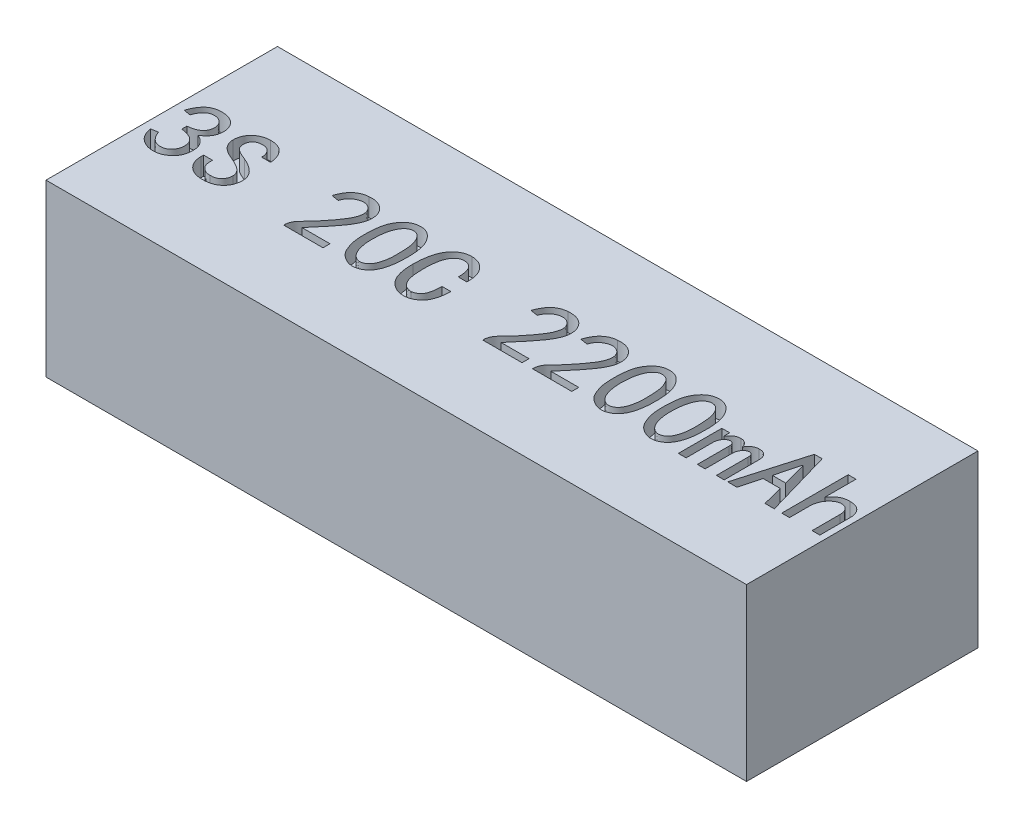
from build123d import *

# Parameters (mm, degrees)
SKETCH_1_W          = 115
SKETCH_1_H          = 38
EXTRUDE_1_DEPTH     = 28
CUT_EXTRUDE_1_DEPTH = 3


with BuildPart() as part:
    # Sketch 1 → Extrude 1 (new body)
    with BuildSketch(Plane(origin=(0, 0, 0), x_dir=(1, 0, 0), z_dir=(0, 1, 0))):
        with Locations((0, 11.87962963)):
            Rectangle(SKETCH_1_W, SKETCH_1_H)
    extrude(amount=EXTRUDE_1_DEPTH)

    # Sketch 2 → Cut-Extrude 1 (cut)
    # profile 1 of 12: a face of its own
    with BuildSketch(Plane(origin=(0, 28, 0), x_dir=(1, 0, 0), z_dir=(0, 1, 0))):
        with BuildLine():
            add(Edge.make_bspline(
                [(-23.615295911, 12.08931365), (-23.609218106, 12.226483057), (-23.597363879, 12.494020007), (-23.563114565, 12.884119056), (-23.52175503, 13.253314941), (-23.46798217, 13.600478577), (-23.401521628, 13.924454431), (-23.326296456, 14.226940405), (-23.23936192, 14.50709014), (-23.111352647, 14.849235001), (-22.919396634, 15.243039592), (-22.644824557, 15.675859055), (-22.325762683, 16.064933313), (-22.023920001, 16.350020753), (-21.762201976, 16.550666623), (-21.553094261, 16.680939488), (-21.33340684, 16.792247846), (-21.102419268, 16.88302215), (-20.86055631, 16.95064026), (-20.608458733, 17.000562), (-20.345294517, 17.031444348), (-20.074116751, 17.040632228), (-19.800895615, 17.027767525), (-19.532494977, 16.98585794), (-19.273493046, 16.911457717), (-19.023712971, 16.809317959), (-18.783834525, 16.67808103), (-18.552650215, 16.518801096), (-18.332900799, 16.327358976), (-18.121847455, 16.111528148), (-17.924717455, 15.873989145), (-17.744146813, 15.619326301), (-17.580885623, 15.350166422), (-17.437110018, 15.065032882), (-17.308232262, 14.766439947), (-17.200115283, 14.451727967), (-17.110667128, 14.122175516), (-17.012170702, 13.656624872), (-16.9255152, 13.039083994), (-16.864465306, 12.257513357), (-16.850534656, 11.424140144), (-16.871277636, 10.703442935), (-16.910378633, 10.119511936), (-16.954832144, 9.695979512), (-17.014540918, 9.294030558), (-17.084049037, 8.911708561), (-17.1710079, 8.551046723), (-17.274055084, 8.211658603), (-17.385392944, 7.89132708), (-17.516443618, 7.593419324), (-17.659178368, 7.315405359), (-17.821908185, 7.060846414), (-17.998203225, 6.826304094), (-18.192736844, 6.613637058), (-18.40804354, 6.427129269), (-18.636632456, 6.257781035), (-18.884642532, 6.113646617), (-19.145464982, 5.991334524), (-19.41409247, 5.893989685), (-19.68717132, 5.8305432), (-19.95955004, 5.792833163), (-20.233148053, 5.792695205), (-20.506344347, 5.8164833), (-20.778016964, 5.879059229), (-21.051516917, 5.965094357), (-21.319518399, 6.086764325), (-21.577463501, 6.226861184), (-21.820258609, 6.377647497), (-22.041268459, 6.541724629), (-22.242258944, 6.716945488), (-22.425737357, 6.901838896), (-22.589538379, 7.098160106), (-22.73196184, 7.306452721), (-22.891117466, 7.599596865), (-23.061623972, 7.9777173), (-23.238097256, 8.443470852), (-23.382329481, 8.920427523), (-23.475073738, 9.330301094), (-23.536219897, 9.673191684), (-23.569862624, 9.954276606), (-23.599086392, 10.256853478), (-23.616748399, 10.580992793), (-23.628496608, 10.926975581), (-23.633609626, 11.295048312), (-23.628137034, 11.685168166), (-23.619651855, 11.952220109), (-23.615295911, 12.08931365)],
                knots=[0, 0, 0, 0, 1.18043416, 2.302333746, 3.366253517, 4.374302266, 5.321670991, 6.208995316, 7.053297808, 7.84229274, 9.348259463, 10.810477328, 12.240076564, 13.663562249, 14.3695339, 15.072606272, 15.778577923, 16.484387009, 17.202829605, 17.934942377, 18.692112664, 19.478485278, 20.265441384, 21.040673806, 21.808439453, 22.577161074, 23.356320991, 24.155029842, 24.986154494, 25.858111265, 26.748121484, 27.637306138, 28.540117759, 29.452135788, 30.380885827, 31.334339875, 32.310628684, 33.31521083, 35.42407972, 37.666773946, 40.052062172, 42.587025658, 43.863776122, 45.083322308, 46.247467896, 47.357025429, 48.423487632, 49.435172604, 50.405897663, 51.337337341, 52.231284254, 53.090220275, 53.931690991, 54.751583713, 55.562922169, 56.377338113, 57.194202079, 58.024663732, 58.851830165, 59.645552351, 60.431282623, 61.21044254, 61.99312915, 62.783838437, 63.60230231, 64.454612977, 65.309477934, 66.125301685, 66.909862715, 67.67340185, 68.415973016, 69.147238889, 69.868837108, 70.581506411, 72.0124375, 73.431838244, 74.861437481, 76.292961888, 77.042577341, 77.855187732, 78.726196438, 79.655959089, 80.645695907, 81.702690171, 82.820655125, 84, 84, 84, 84], degree=3))
        make_face()
        with BuildLine():
            add(Edge.make_bspline(
                [(-22.274972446, 12.472263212), (-22.289462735, 12.328158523), (-22.318009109, 12.044267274), (-22.341356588, 11.623120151), (-22.348009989, 11.213894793), (-22.341917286, 10.816425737), (-22.318420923, 10.431490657), (-22.278332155, 10.058344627), (-22.221226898, 9.69724956), (-22.151335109, 9.349163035), (-22.067595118, 9.019648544), (-21.968286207, 8.713183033), (-21.855248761, 8.431999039), (-21.730202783, 8.175672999), (-21.592940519, 7.943898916), (-21.440905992, 7.737992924), (-21.278364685, 7.553574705), (-21.100459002, 7.398593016), (-20.917990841, 7.268441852), (-20.731437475, 7.167315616), (-20.543841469, 7.095657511), (-20.35448681, 7.051842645), (-20.164056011, 7.037852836), (-19.972473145, 7.051403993), (-19.781155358, 7.098701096), (-19.591052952, 7.171190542), (-19.407620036, 7.271031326), (-19.234086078, 7.391589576), (-19.074069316, 7.535561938), (-18.927485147, 7.701403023), (-18.79517177, 7.890138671), (-18.674107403, 8.098542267), (-18.567803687, 8.330070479), (-18.44279967, 8.669069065), (-18.316908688, 9.120524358), (-18.2049069, 9.684656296), (-18.1388455, 10.272972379), (-18.121524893, 10.876584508), (-18.132786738, 11.47634776), (-18.146293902, 12.057352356), (-18.178772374, 12.609781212), (-18.217642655, 13.136447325), (-18.283609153, 13.639702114), (-18.405176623, 14.116909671), (-18.575456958, 14.569363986), (-18.75023127, 14.926530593), (-18.917730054, 15.185793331), (-19.049773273, 15.359751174), (-19.196571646, 15.505113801), (-19.351362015, 15.629036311), (-19.517745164, 15.723381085), (-19.694216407, 15.793953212), (-19.880698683, 15.837687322), (-20.074365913, 15.859251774), (-20.269479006, 15.855482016), (-20.461127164, 15.821236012), (-20.647006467, 15.761344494), (-20.828286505, 15.67608164), (-21.001163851, 15.560680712), (-21.168401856, 15.419440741), (-21.328116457, 15.249983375), (-21.485445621, 15.056907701), (-21.628957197, 14.832709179), (-21.761680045, 14.581564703), (-21.879380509, 14.300247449), (-21.984793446, 13.990385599), (-22.079464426, 13.651995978), (-22.159063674, 13.284875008), (-22.225116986, 12.888730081), (-22.257975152, 12.614249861), (-22.274972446, 12.472263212)],
                knots=[0, 0, 0, 0, 1.378198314, 2.715098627, 4.012594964, 5.272602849, 6.497213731, 7.681415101, 8.842769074, 9.975170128, 11.059162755, 12.076494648, 13.038717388, 13.940857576, 14.788360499, 15.598271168, 16.373595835, 17.122768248, 17.838466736, 18.502782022, 19.136468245, 19.744060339, 20.345653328, 20.947246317, 21.563841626, 22.214212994, 22.87852828, 23.546305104, 24.220743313, 24.921956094, 25.648106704, 26.41081768, 27.212668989, 28.069279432, 29.84713992, 31.666334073, 33.537864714, 35.473745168, 37.408579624, 39.246547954, 41.003985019, 42.674193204, 44.272363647, 45.827394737, 47.348405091, 48.867584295, 49.599750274, 50.283750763, 50.94125936, 51.560811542, 52.165388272, 52.754418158, 53.363720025, 53.982318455, 54.604903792, 55.213928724, 55.828148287, 56.458765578, 57.113918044, 57.800421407, 58.537638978, 59.326979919, 60.167286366, 61.066273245, 62.027297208, 63.065989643, 64.179487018, 65.369443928, 66.639232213, 68, 68, 68, 68], degree=3))
        make_face(mode=Mode.SUBTRACT)
    # profile 2 of 12: a face of its own
    with BuildSketch(Plane(origin=(0, 28, 0), x_dir=(1, 0, 0), z_dir=(0, 1, 0))):
        with BuildLine():
            add(Edge.make_bspline(
                [(17.232657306, 12.08931365), (17.23873511, 12.226483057), (17.250589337, 12.494020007), (17.284838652, 12.884119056), (17.326198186, 13.253314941), (17.379971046, 13.600478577), (17.446431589, 13.924454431), (17.52165676, 14.226940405), (17.608591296, 14.50709014), (17.73660057, 14.849235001), (17.928556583, 15.243039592), (18.203128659, 15.675859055), (18.522190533, 16.064933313), (18.824033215, 16.350020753), (19.085751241, 16.550666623), (19.294858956, 16.680939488), (19.514546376, 16.792247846), (19.745533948, 16.88302215), (19.987396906, 16.95064026), (20.239494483, 17.000562), (20.502658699, 17.031444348), (20.773836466, 17.040632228), (21.047057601, 17.027767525), (21.31545824, 16.98585794), (21.57446017, 16.911457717), (21.824240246, 16.809317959), (22.064118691, 16.67808103), (22.295303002, 16.518801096), (22.515052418, 16.327358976), (22.726105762, 16.111528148), (22.923235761, 15.873989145), (23.103806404, 15.619326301), (23.267067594, 15.350166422), (23.410843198, 15.065032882), (23.539720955, 14.766439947), (23.647837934, 14.451727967), (23.737286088, 14.122175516), (23.835782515, 13.656624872), (23.922438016, 13.039083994), (23.98348791, 12.257513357), (23.997418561, 11.424140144), (23.976675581, 10.703442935), (23.937574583, 10.119511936), (23.893121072, 9.695979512), (23.833412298, 9.294030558), (23.76390418, 8.911708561), (23.676945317, 8.551046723), (23.573898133, 8.211658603), (23.462560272, 7.89132708), (23.331509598, 7.593419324), (23.188774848, 7.315405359), (23.026045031, 7.060846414), (22.849749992, 6.826304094), (22.655216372, 6.613637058), (22.439909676, 6.427129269), (22.211320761, 6.257781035), (21.963310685, 6.113646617), (21.702488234, 5.991334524), (21.433860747, 5.893989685), (21.160781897, 5.8305432), (20.888403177, 5.792833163), (20.614805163, 5.792695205), (20.341608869, 5.8164833), (20.069936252, 5.879059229), (19.7964363, 5.965094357), (19.528434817, 6.086764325), (19.270489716, 6.226861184), (19.027694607, 6.377647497), (18.806684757, 6.541724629), (18.605694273, 6.716945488), (18.422215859, 6.901838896), (18.258414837, 7.098160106), (18.115991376, 7.306452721), (17.95683575, 7.599596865), (17.786329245, 7.9777173), (17.609855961, 8.443470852), (17.465623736, 8.920427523), (17.372879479, 9.330301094), (17.311733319, 9.673191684), (17.278090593, 9.954276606), (17.248866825, 10.256853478), (17.231204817, 10.580992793), (17.219456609, 10.926975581), (17.21434359, 11.295048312), (17.219816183, 11.685168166), (17.228301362, 11.952220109), (17.232657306, 12.08931365)],
                knots=[0, 0, 0, 0, 1.18043416, 2.302333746, 3.366253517, 4.374302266, 5.321670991, 6.208995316, 7.053297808, 7.84229274, 9.348259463, 10.810477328, 12.240076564, 13.663562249, 14.3695339, 15.072606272, 15.778577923, 16.484387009, 17.202829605, 17.934942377, 18.692112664, 19.478485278, 20.265441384, 21.040673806, 21.808439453, 22.577161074, 23.356320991, 24.155029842, 24.986154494, 25.858111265, 26.748121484, 27.637306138, 28.540117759, 29.452135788, 30.380885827, 31.334339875, 32.310628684, 33.31521083, 35.42407972, 37.666773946, 40.052062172, 42.587025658, 43.863776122, 45.083322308, 46.247467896, 47.357025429, 48.423487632, 49.435172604, 50.405897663, 51.337337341, 52.231284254, 53.090220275, 53.931690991, 54.751583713, 55.562922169, 56.377338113, 57.194202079, 58.024663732, 58.851830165, 59.645552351, 60.431282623, 61.21044254, 61.99312915, 62.783838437, 63.60230231, 64.454612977, 65.309477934, 66.125301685, 66.909862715, 67.67340185, 68.415973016, 69.147238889, 69.868837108, 70.581506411, 72.0124375, 73.431838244, 74.861437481, 76.292961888, 77.042577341, 77.855187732, 78.726196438, 79.655959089, 80.645695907, 81.702690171, 82.820655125, 84, 84, 84, 84], degree=3))
        make_face()
        with BuildLine():
            add(Edge.make_bspline(
                [(18.57298077, 12.472263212), (18.558490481, 12.328158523), (18.529944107, 12.044267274), (18.506596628, 11.623120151), (18.499943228, 11.213894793), (18.50603593, 10.816425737), (18.529532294, 10.431490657), (18.569621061, 10.058344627), (18.626726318, 9.69724956), (18.696618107, 9.349163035), (18.780358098, 9.019648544), (18.879667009, 8.713183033), (18.992704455, 8.431999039), (19.117750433, 8.175672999), (19.255012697, 7.943898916), (19.407047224, 7.737992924), (19.569588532, 7.553574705), (19.747494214, 7.398593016), (19.929962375, 7.268441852), (20.116515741, 7.167315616), (20.304111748, 7.095657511), (20.493466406, 7.051842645), (20.683897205, 7.037852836), (20.875480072, 7.051403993), (21.066797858, 7.098701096), (21.256900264, 7.171190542), (21.440333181, 7.271031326), (21.613867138, 7.391589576), (21.7738839, 7.535561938), (21.920468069, 7.701403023), (22.052781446, 7.890138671), (22.173845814, 8.098542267), (22.280149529, 8.330070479), (22.405153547, 8.669069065), (22.531044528, 9.120524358), (22.643046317, 9.684656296), (22.709107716, 10.272972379), (22.726428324, 10.876584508), (22.715166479, 11.47634776), (22.701659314, 12.057352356), (22.669180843, 12.609781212), (22.630310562, 13.136447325), (22.564344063, 13.639702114), (22.442776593, 14.116909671), (22.272496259, 14.569363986), (22.097721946, 14.926530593), (21.930223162, 15.185793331), (21.798179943, 15.359751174), (21.65138157, 15.505113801), (21.496591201, 15.629036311), (21.330208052, 15.723381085), (21.15373681, 15.793953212), (20.967254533, 15.837687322), (20.773587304, 15.859251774), (20.578474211, 15.855482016), (20.386826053, 15.821236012), (20.200946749, 15.761344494), (20.019666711, 15.67608164), (19.846789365, 15.560680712), (19.67955136, 15.419440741), (19.519836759, 15.249983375), (19.362507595, 15.056907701), (19.21899602, 14.832709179), (19.086273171, 14.581564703), (18.968572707, 14.300247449), (18.86315977, 13.990385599), (18.768488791, 13.651995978), (18.688889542, 13.284875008), (18.622836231, 12.888730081), (18.589978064, 12.614249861), (18.57298077, 12.472263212)],
                knots=[0, 0, 0, 0, 1.378198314, 2.715098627, 4.012594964, 5.272602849, 6.497213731, 7.681415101, 8.842769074, 9.975170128, 11.059162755, 12.076494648, 13.038717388, 13.940857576, 14.788360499, 15.598271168, 16.373595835, 17.122768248, 17.838466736, 18.502782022, 19.136468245, 19.744060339, 20.345653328, 20.947246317, 21.563841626, 22.214212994, 22.87852828, 23.546305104, 24.220743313, 24.921956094, 25.648106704, 26.41081768, 27.212668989, 28.069279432, 29.84713992, 31.666334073, 33.537864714, 35.473745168, 37.408579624, 39.246547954, 41.003985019, 42.674193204, 44.272363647, 45.827394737, 47.348405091, 48.867584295, 49.599750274, 50.283750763, 50.94125936, 51.560811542, 52.165388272, 52.754418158, 53.363720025, 53.982318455, 54.604903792, 55.213928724, 55.828148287, 56.458765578, 57.113918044, 57.800421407, 58.537638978, 59.326979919, 60.167286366, 61.066273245, 62.027297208, 63.065989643, 64.179487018, 65.369443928, 66.639232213, 68, 68, 68, 68], degree=3))
        make_face(mode=Mode.SUBTRACT)
    # profile 3 of 12: a face of its own
    with BuildSketch(Plane(origin=(0, 28, 0), x_dir=(1, 0, 0), z_dir=(0, 1, 0))):
        with BuildLine():
            add(Edge.make_bspline(
                [(25.402247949, 12.08931365), (25.408325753, 12.226483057), (25.42017998, 12.494020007), (25.454429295, 12.884119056), (25.495788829, 13.253314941), (25.54956169, 13.600478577), (25.616022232, 13.924454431), (25.691247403, 14.226940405), (25.778181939, 14.50709014), (25.906191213, 14.849235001), (26.098147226, 15.243039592), (26.372719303, 15.675859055), (26.691781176, 16.064933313), (26.993623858, 16.350020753), (27.255341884, 16.550666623), (27.464449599, 16.680939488), (27.684137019, 16.792247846), (27.915124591, 16.88302215), (28.156987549, 16.95064026), (28.409085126, 17.000562), (28.672249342, 17.031444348), (28.943427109, 17.040632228), (29.216648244, 17.027767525), (29.485048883, 16.98585794), (29.744050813, 16.911457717), (29.993830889, 16.809317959), (30.233709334, 16.67808103), (30.464893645, 16.518801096), (30.684643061, 16.327358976), (30.895696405, 16.111528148), (31.092826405, 15.873989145), (31.273397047, 15.619326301), (31.436658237, 15.350166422), (31.580433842, 15.065032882), (31.709311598, 14.766439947), (31.817428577, 14.451727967), (31.906876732, 14.122175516), (32.005373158, 13.656624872), (32.092028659, 13.039083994), (32.153078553, 12.257513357), (32.167009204, 11.424140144), (32.146266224, 10.703442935), (32.107165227, 10.119511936), (32.062711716, 9.695979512), (32.003002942, 9.294030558), (31.933494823, 8.911708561), (31.84653596, 8.551046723), (31.743488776, 8.211658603), (31.632150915, 7.89132708), (31.501100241, 7.593419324), (31.358365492, 7.315405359), (31.195635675, 7.060846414), (31.019340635, 6.826304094), (30.824807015, 6.613637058), (30.609500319, 6.427129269), (30.380911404, 6.257781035), (30.132901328, 6.113646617), (29.872078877, 5.991334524), (29.60345139, 5.893989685), (29.33037254, 5.8305432), (29.05799382, 5.792833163), (28.784395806, 5.792695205), (28.511199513, 5.8164833), (28.239526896, 5.879059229), (27.966026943, 5.965094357), (27.69802546, 6.086764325), (27.440080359, 6.226861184), (27.19728525, 6.377647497), (26.9762754, 6.541724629), (26.775284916, 6.716945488), (26.591806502, 6.901838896), (26.428005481, 7.098160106), (26.285582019, 7.306452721), (26.126426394, 7.599596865), (25.955919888, 7.9777173), (25.779446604, 8.443470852), (25.635214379, 8.920427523), (25.542470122, 9.330301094), (25.481323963, 9.673191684), (25.447681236, 9.954276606), (25.418457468, 10.256853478), (25.400795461, 10.580992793), (25.389047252, 10.926975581), (25.383934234, 11.295048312), (25.389406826, 11.685168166), (25.397892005, 11.952220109), (25.402247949, 12.08931365)],
                knots=[0, 0, 0, 0, 1.18043416, 2.302333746, 3.366253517, 4.374302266, 5.321670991, 6.208995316, 7.053297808, 7.84229274, 9.348259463, 10.810477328, 12.240076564, 13.663562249, 14.3695339, 15.072606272, 15.778577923, 16.484387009, 17.202829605, 17.934942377, 18.692112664, 19.478485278, 20.265441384, 21.040673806, 21.808439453, 22.577161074, 23.356320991, 24.155029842, 24.986154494, 25.858111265, 26.748121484, 27.637306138, 28.540117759, 29.452135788, 30.380885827, 31.334339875, 32.310628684, 33.31521083, 35.42407972, 37.666773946, 40.052062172, 42.587025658, 43.863776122, 45.083322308, 46.247467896, 47.357025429, 48.423487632, 49.435172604, 50.405897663, 51.337337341, 52.231284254, 53.090220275, 53.931690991, 54.751583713, 55.562922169, 56.377338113, 57.194202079, 58.024663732, 58.851830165, 59.645552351, 60.431282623, 61.21044254, 61.99312915, 62.783838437, 63.60230231, 64.454612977, 65.309477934, 66.125301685, 66.909862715, 67.67340185, 68.415973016, 69.147238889, 69.868837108, 70.581506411, 72.0124375, 73.431838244, 74.861437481, 76.292961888, 77.042577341, 77.855187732, 78.726196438, 79.655959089, 80.645695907, 81.702690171, 82.820655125, 84, 84, 84, 84], degree=3))
        make_face()
        with BuildLine():
            add(Edge.make_bspline(
                [(26.742571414, 12.472263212), (26.728081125, 12.328158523), (26.699534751, 12.044267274), (26.676187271, 11.623120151), (26.669533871, 11.213894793), (26.675626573, 10.816425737), (26.699122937, 10.431490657), (26.739211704, 10.058344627), (26.796316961, 9.69724956), (26.86620875, 9.349163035), (26.949948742, 9.019648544), (27.049257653, 8.713183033), (27.162295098, 8.431999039), (27.287341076, 8.175672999), (27.424603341, 7.943898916), (27.576637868, 7.737992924), (27.739179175, 7.553574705), (27.917084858, 7.398593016), (28.099553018, 7.268441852), (28.286106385, 7.167315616), (28.473702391, 7.095657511), (28.66305705, 7.051842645), (28.853487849, 7.037852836), (29.045070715, 7.051403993), (29.236388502, 7.098701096), (29.426490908, 7.171190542), (29.609923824, 7.271031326), (29.783457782, 7.391589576), (29.943474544, 7.535561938), (30.090058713, 7.701403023), (30.222372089, 7.890138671), (30.343436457, 8.098542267), (30.449740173, 8.330070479), (30.57474419, 8.669069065), (30.700635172, 9.120524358), (30.81263696, 9.684656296), (30.87869836, 10.272972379), (30.896018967, 10.876584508), (30.884757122, 11.47634776), (30.871249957, 12.057352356), (30.838771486, 12.609781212), (30.799901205, 13.136447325), (30.733934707, 13.639702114), (30.612367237, 14.116909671), (30.442086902, 14.569363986), (30.26731259, 14.926530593), (30.099813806, 15.185793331), (29.967770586, 15.359751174), (29.820972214, 15.505113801), (29.666181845, 15.629036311), (29.499798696, 15.723381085), (29.323327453, 15.793953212), (29.136845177, 15.837687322), (28.943177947, 15.859251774), (28.748064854, 15.855482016), (28.556416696, 15.821236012), (28.370537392, 15.761344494), (28.189257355, 15.67608164), (28.016380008, 15.560680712), (27.849142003, 15.419440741), (27.689427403, 15.249983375), (27.532098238, 15.056907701), (27.388586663, 14.832709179), (27.255863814, 14.581564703), (27.138163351, 14.300247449), (27.032750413, 13.990385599), (26.938079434, 13.651995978), (26.858480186, 13.284875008), (26.792426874, 12.888730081), (26.759568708, 12.614249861), (26.742571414, 12.472263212)],
                knots=[0, 0, 0, 0, 1.378198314, 2.715098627, 4.012594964, 5.272602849, 6.497213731, 7.681415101, 8.842769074, 9.975170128, 11.059162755, 12.076494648, 13.038717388, 13.940857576, 14.788360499, 15.598271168, 16.373595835, 17.122768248, 17.838466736, 18.502782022, 19.136468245, 19.744060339, 20.345653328, 20.947246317, 21.563841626, 22.214212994, 22.87852828, 23.546305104, 24.220743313, 24.921956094, 25.648106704, 26.41081768, 27.212668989, 28.069279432, 29.84713992, 31.666334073, 33.537864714, 35.473745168, 37.408579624, 39.246547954, 41.003985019, 42.674193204, 44.272363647, 45.827394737, 47.348405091, 48.867584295, 49.599750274, 50.283750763, 50.94125936, 51.560811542, 52.165388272, 52.754418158, 53.363720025, 53.982318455, 54.604903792, 55.213928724, 55.828148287, 56.458765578, 57.113918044, 57.800421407, 58.537638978, 59.326979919, 60.167286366, 61.066273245, 62.027297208, 63.065989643, 64.179487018, 65.369443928, 66.639232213, 68, 68, 68, 68], degree=3))
        make_face(mode=Mode.SUBTRACT)
    # profile 4 of 12: a face of its own
    with BuildSketch(Plane(origin=(0, 28, 0), x_dir=(1, 0, 0), z_dir=(0, 1, 0))):
        with BuildLine():
            Line((-56.229833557, 8.739686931), (-55.080984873, 8.931161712))
            add(Edge.make_bspline(
                [(-55.080984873, 8.931161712), (-55.035699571, 8.797328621), (-54.946753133, 8.534462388), (-54.754562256, 8.171429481), (-54.52484636, 7.843868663), (-54.304459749, 7.598565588), (-54.105253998, 7.431053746), (-53.948135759, 7.321438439), (-53.783011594, 7.227401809), (-53.605227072, 7.158407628), (-53.421336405, 7.099036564), (-53.226377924, 7.065711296), (-53.024100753, 7.046671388), (-52.81596911, 7.043396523), (-52.608527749, 7.062360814), (-52.408191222, 7.100273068), (-52.218130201, 7.156317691), (-52.039137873, 7.234586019), (-51.873741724, 7.336005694), (-51.715570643, 7.451340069), (-51.570704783, 7.58999323), (-51.440530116, 7.747724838), (-51.322796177, 7.917037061), (-51.221048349, 8.093954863), (-51.136997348, 8.277292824), (-51.074203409, 8.467124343), (-51.025365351, 8.662083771), (-50.998413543, 8.863402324), (-50.985489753, 9.07052033), (-50.993952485, 9.280785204), (-51.015361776, 9.488399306), (-51.059097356, 9.686840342), (-51.117930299, 9.872608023), (-51.190957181, 10.049195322), (-51.286101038, 10.210527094), (-51.395649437, 10.361428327), (-51.521941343, 10.500049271), (-51.668051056, 10.625610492), (-51.832490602, 10.742164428), (-52.018896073, 10.849795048), (-52.229882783, 10.944332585), (-52.46099189, 11.035466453), (-52.716948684, 11.112245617), (-52.994456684, 11.182873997), (-53.29577485, 11.244650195), (-53.504897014, 11.276314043), (-53.613011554, 11.292684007)],
                knots=[0, 0, 0, 0, 1.854799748, 3.643076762, 5.375778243, 7.105784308, 7.958514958, 8.791774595, 9.621744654, 10.44880128, 11.294076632, 12.157496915, 13.041787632, 13.96367637, 14.889223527, 15.774908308, 16.640004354, 17.48869958, 18.334228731, 19.185637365, 20.057465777, 20.961908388, 21.86984341, 22.765285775, 23.641349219, 24.5158806, 25.390105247, 26.279235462, 27.181837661, 28.114543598, 29.042174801, 29.921843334, 30.780091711, 31.601551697, 32.427634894, 33.235597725, 34.049381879, 34.886366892, 35.762920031, 36.695625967, 37.710569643, 38.799256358, 39.959035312, 41.220118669, 42.562822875, 44, 44, 44, 44], degree=3))
            Line((-53.613011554, 11.292684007), (-53.613011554, 12.122408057))
            add(Edge.make_bspline(
                [(-53.613011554, 12.122408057), (-53.50484058, 12.133453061), (-53.295451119, 12.154833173), (-52.994551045, 12.21146518), (-52.715885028, 12.275244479), (-52.46067626, 12.35628272), (-52.228073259, 12.450704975), (-52.017147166, 12.557993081), (-51.830496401, 12.682473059), (-51.666758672, 12.82001499), (-51.52357617, 12.969539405), (-51.40276261, 13.131017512), (-51.302027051, 13.302753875), (-51.223377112, 13.486227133), (-51.167917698, 13.681073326), (-51.128118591, 13.885815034), (-51.116372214, 14.101648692), (-51.120527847, 14.323811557), (-51.144302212, 14.543796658), (-51.194928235, 14.752269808), (-51.266204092, 14.945053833), (-51.357176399, 15.124131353), (-51.476087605, 15.283776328), (-51.613447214, 15.429167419), (-51.773588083, 15.557430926), (-51.952700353, 15.66759102), (-52.144402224, 15.757561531), (-52.34059408, 15.830817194), (-52.541262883, 15.874761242), (-52.743929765, 15.89860766), (-52.950257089, 15.902333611), (-53.15922997, 15.876601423), (-53.371490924, 15.83152499), (-53.585587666, 15.763879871), (-53.798581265, 15.668449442), (-53.998334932, 15.53063478), (-54.185132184, 15.35762769), (-54.365419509, 15.152664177), (-54.527843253, 14.906987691), (-54.684780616, 14.629578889), (-54.829553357, 14.315708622), (-54.91092863, 14.090626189), (-54.953335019, 13.973330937)],
                knots=[0, 0, 0, 0, 1.385117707, 2.68120955, 3.899080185, 5.026526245, 6.089471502, 7.095537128, 8.036926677, 8.942108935, 9.815771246, 10.669349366, 11.506404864, 12.347666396, 13.205663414, 14.084102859, 14.999917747, 15.954128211, 16.914501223, 17.813254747, 18.680661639, 19.529560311, 20.363114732, 21.208382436, 22.07252795, 22.96987783, 23.881720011, 24.767988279, 25.632833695, 26.492298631, 27.366018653, 28.255410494, 29.169296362, 30.128408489, 31.112431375, 32.1318401, 33.205217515, 34.351116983, 35.601710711, 36.950682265, 38.410935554, 40, 40, 40, 40], degree=3))
            Line((-54.953335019, 13.973330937), (-56.102183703, 14.164805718))
            add(Edge.make_bspline(
                [(-56.102183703, 14.164805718), (-56.035214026, 14.349666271), (-55.904717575, 14.709883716), (-55.66086211, 15.216407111), (-55.377851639, 15.672894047), (-55.112543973, 16.017419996), (-54.879515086, 16.264848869), (-54.686271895, 16.424345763), (-54.481424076, 16.569308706), (-54.259615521, 16.690593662), (-54.02347697, 16.794035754), (-53.77184213, 16.873168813), (-53.506293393, 16.934738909), (-53.229587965, 16.976516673), (-52.950770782, 16.998653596), (-52.676806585, 17.00765229), (-52.411692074, 16.993859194), (-52.154580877, 16.970396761), (-51.907563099, 16.924069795), (-51.669179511, 16.863421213), (-51.440924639, 16.781805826), (-51.220158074, 16.688635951), (-51.013878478, 16.577205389), (-50.819583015, 16.455173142), (-50.645706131, 16.313492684), (-50.482099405, 16.16372319), (-50.341642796, 15.993368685), (-50.211943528, 15.812703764), (-50.09885297, 15.617439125), (-50.005119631, 15.408495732), (-49.926827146, 15.192122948), (-49.868240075, 14.968034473), (-49.824529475, 14.739977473), (-49.804021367, 14.505652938), (-49.801621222, 14.26775437), (-49.818631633, 14.024364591), (-49.854576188, 13.776392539), (-49.907791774, 13.524469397), (-49.984375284, 13.272700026), (-50.094648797, 13.027837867), (-50.23480732, 12.79126888), (-50.40458964, 12.562645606), (-50.603727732, 12.342190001), (-50.835187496, 12.132670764), (-51.093374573, 11.927523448), (-51.281971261, 11.803405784), (-51.379139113, 11.739458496)],
                knots=[0, 0, 0, 0, 2.088435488, 4.069504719, 5.960900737, 7.786563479, 8.680771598, 9.566313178, 10.444341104, 11.343825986, 12.247587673, 13.179685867, 14.142420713, 15.141886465, 16.150152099, 17.113396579, 18.05212794, 18.969441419, 19.854666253, 20.719823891, 21.58047219, 22.428151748, 23.263500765, 24.069461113, 24.861911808, 25.643808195, 26.422154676, 27.202794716, 28.005617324, 28.815006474, 29.633397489, 30.44783822, 31.273903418, 32.097929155, 32.94366283, 33.799737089, 34.68784804, 35.604243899, 36.533818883, 37.478357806, 38.450549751, 39.450331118, 40.49965591, 41.60193164, 42.764479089, 44, 44, 44, 44], degree=3))
            add(Edge.make_bspline(
                [(-51.379139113, 11.739458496), (-51.236530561, 11.671964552), (-50.95734295, 11.539830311), (-50.584004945, 11.272510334), (-50.263511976, 10.95732089), (-50.041703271, 10.655638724), (-49.891812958, 10.392543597), (-49.802584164, 10.176296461), (-49.734369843, 9.945521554), (-49.685078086, 9.701070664), (-49.653792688, 9.441830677), (-49.645957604, 9.167531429), (-49.65510932, 8.877679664), (-49.685939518, 8.578392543), (-49.735225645, 8.277951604), (-49.814315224, 7.988673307), (-49.915452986, 7.713738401), (-50.041947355, 7.452640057), (-50.194834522, 7.207659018), (-50.375398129, 6.979294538), (-50.575587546, 6.762497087), (-50.802696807, 6.566504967), (-51.043315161, 6.387948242), (-51.295836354, 6.233259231), (-51.55571352, 6.102763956), (-51.823963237, 5.998117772), (-52.100391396, 5.919920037), (-52.384370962, 5.865907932), (-52.676898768, 5.834286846), (-52.974242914, 5.830917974), (-53.27081648, 5.848597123), (-53.559536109, 5.892936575), (-53.839543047, 5.952066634), (-54.108323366, 6.039621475), (-54.368949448, 6.144241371), (-54.616792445, 6.275832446), (-54.855965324, 6.426000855), (-55.084064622, 6.597050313), (-55.297648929, 6.791173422), (-55.491840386, 7.007716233), (-55.668441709, 7.243735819), (-55.817820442, 7.504583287), (-55.955516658, 7.781755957), (-56.066263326, 8.082928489), (-56.163267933, 8.40291574), (-56.207313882, 8.625754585), (-56.229833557, 8.739686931)],
                knots=[0, 0, 0, 0, 1.556863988, 3.047903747, 4.51274202, 5.983117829, 6.732724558, 7.500714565, 8.289161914, 9.10779992, 9.96267821, 10.866591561, 11.817204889, 12.826910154, 13.838355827, 14.822602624, 15.786048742, 16.729939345, 17.685039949, 18.633769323, 19.603521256, 20.596937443, 21.593797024, 22.562140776, 23.519904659, 24.464277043, 25.403497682, 26.355035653, 27.318261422, 28.307425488, 29.290655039, 30.251043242, 31.192037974, 32.115630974, 33.041191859, 33.964292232, 34.884727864, 35.830159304, 36.778345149, 37.732302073, 38.701115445, 39.685485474, 40.699027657, 41.756353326, 42.852875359, 44, 44, 44, 44], degree=3))
        make_face()
    # profile 5 of 12: a face of its own
    with BuildSketch(Plane(origin=(0, 28, 0), x_dir=(1, 0, 0), z_dir=(0, 1, 0))):
        with BuildLine():
            add(Edge.make_bspline(
                [(-41.294800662, 8.994986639), (-41.297425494, 8.875878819), (-41.302553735, 8.643173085), (-41.345563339, 8.302643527), (-41.418319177, 7.981134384), (-41.520402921, 7.67843332), (-41.650901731, 7.395335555), (-41.810761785, 7.130341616), (-41.999937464, 6.884178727), (-42.218068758, 6.659930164), (-42.459543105, 6.458382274), (-42.723630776, 6.282848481), (-43.008375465, 6.132803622), (-43.31568509, 6.012900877), (-43.642295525, 5.917881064), (-43.990679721, 5.852690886), (-44.359003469, 5.81194238), (-44.612011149, 5.80651482), (-44.741346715, 5.803740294)],
                knots=[0, 0, 0, 0, 1.076144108, 2.102505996, 3.095825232, 4.050645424, 4.984196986, 5.907479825, 6.841845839, 7.783590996, 8.729097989, 9.679099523, 10.644246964, 11.632062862, 12.655232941, 13.713869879, 14.831347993, 16, 16, 16, 16], degree=3))
            add(Edge.make_bspline(
                [(-44.741346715, 5.803740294), (-44.870710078, 5.806250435), (-45.123076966, 5.811147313), (-45.489710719, 5.855319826), (-45.836216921, 5.921990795), (-46.159457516, 6.022187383), (-46.462501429, 6.14631499), (-46.740538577, 6.302978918), (-47.001374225, 6.481095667), (-47.232495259, 6.693676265), (-47.444569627, 6.920671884), (-47.623070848, 7.169000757), (-47.779303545, 7.427143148), (-47.903959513, 7.701368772), (-48.005342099, 7.98790835), (-48.071726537, 8.290546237), (-48.116546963, 8.605969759), (-48.121530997, 8.82147223), (-48.124067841, 8.931161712)],
                knots=[0, 0, 0, 0, 1.196538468, 2.33425201, 3.412396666, 4.457161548, 5.460527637, 6.436390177, 7.405227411, 8.375846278, 9.335670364, 10.274835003, 11.200142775, 12.12337999, 13.057237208, 14.007039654, 14.985594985, 16, 16, 16, 16], degree=3))
            Line((-48.124067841, 8.931161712), (-48.124067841, 9.3779362))
            Line((-48.124067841, 9.3779362), (-46.656094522, 9.3779362))
            Line((-46.656094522, 9.3779362), (-46.656094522, 8.994986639))
            add(Edge.make_bspline(
                [(-46.656094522, 8.994986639), (-46.654118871, 8.91770281), (-46.65025687, 8.766628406), (-46.624943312, 8.547218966), (-46.579731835, 8.341291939), (-46.516332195, 8.150330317), (-46.435179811, 7.972428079), (-46.335498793, 7.80938248), (-46.219185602, 7.658454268), (-46.040301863, 7.48166718), (-45.790577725, 7.298890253), (-45.464462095, 7.132524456), (-45.110023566, 7.035848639), (-44.865626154, 7.022965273), (-44.741346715, 7.016413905)],
                knots=[0, 0, 0, 0, 0.899937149, 1.759196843, 2.567308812, 3.350717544, 4.097934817, 4.839099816, 5.571408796, 6.31103876, 7.760779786, 9.155922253, 10.553747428, 12, 12, 12, 12], degree=3))
            add(Edge.make_bspline(
                [(-44.741346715, 7.016413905), (-44.659360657, 7.018612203), (-44.499774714, 7.022891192), (-44.268515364, 7.044857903), (-44.05423804, 7.088058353), (-43.857486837, 7.146264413), (-43.677017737, 7.222541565), (-43.514870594, 7.317042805), (-43.367145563, 7.426488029), (-43.199782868, 7.597564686), (-43.023405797, 7.83579404), (-42.873290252, 8.155818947), (-42.77951616, 8.502763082), (-42.768446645, 8.743810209), (-42.762773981, 8.867336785)],
                knots=[0, 0, 0, 0, 0.962219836, 1.872961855, 2.721515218, 3.522926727, 4.276799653, 5.014164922, 5.72050659, 6.426545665, 7.815246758, 9.175842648, 10.55273742, 12, 12, 12, 12], degree=3))
            add(Edge.make_bspline(
                [(-42.762773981, 8.867336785), (-42.764730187, 8.920237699), (-42.768607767, 9.025097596), (-42.795726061, 9.181420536), (-42.840126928, 9.334794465), (-42.904980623, 9.484101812), (-42.986831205, 9.630384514), (-43.085750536, 9.773619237), (-43.202939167, 9.91430977), (-43.387909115, 10.101262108), (-43.664396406, 10.326526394), (-44.048930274, 10.581585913), (-44.49849421, 10.82247644), (-44.825285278, 10.963457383), (-44.996646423, 11.0373843)],
                knots=[0, 0, 0, 0, 0.578251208, 1.146206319, 1.729632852, 2.320140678, 2.921792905, 3.559846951, 4.220588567, 4.921185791, 6.432399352, 8.109791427, 9.960070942, 12, 12, 12, 12], degree=3))
            add(Edge.make_bspline(
                [(-44.996646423, 11.0373843), (-45.119887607, 11.085453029), (-45.35919432, 11.178791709), (-45.702581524, 11.327712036), (-46.019582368, 11.480162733), (-46.308220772, 11.639538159), (-46.571728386, 11.798849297), (-46.807061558, 11.964873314), (-47.015008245, 12.135294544), (-47.200203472, 12.307567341), (-47.356388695, 12.490365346), (-47.496111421, 12.676166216), (-47.608545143, 12.874495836), (-47.704316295, 13.077824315), (-47.778521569, 13.290068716), (-47.828993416, 13.51058088), (-47.864938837, 13.73892517), (-47.867478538, 13.894389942), (-47.868768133, 13.973330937)],
                knots=[0, 0, 0, 0, 1.442788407, 2.80157118, 4.081608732, 5.277882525, 6.396683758, 7.438774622, 8.41600694, 9.327939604, 10.193066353, 11.035393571, 11.859457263, 12.674643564, 13.484648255, 14.306018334, 15.139839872, 16, 16, 16, 16], degree=3))
            add(Edge.make_bspline(
                [(-47.868768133, 13.973330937), (-47.86608285, 14.082198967), (-47.86080771, 14.296066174), (-47.818159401, 14.609230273), (-47.744507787, 14.906165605), (-47.642777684, 15.186962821), (-47.511364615, 15.451433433), (-47.352529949, 15.700597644), (-47.164510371, 15.934346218), (-46.947553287, 16.146789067), (-46.711778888, 16.339415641), (-46.464131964, 16.511240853), (-46.202658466, 16.652939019), (-45.93102628, 16.769181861), (-45.649983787, 16.862855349), (-45.356460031, 16.924847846), (-45.05308504, 16.96795898), (-44.84630305, 16.971370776), (-44.741346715, 16.973102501)],
                knots=[0, 0, 0, 0, 1.07870255, 2.119071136, 3.124805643, 4.105581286, 5.072990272, 6.045680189, 7.028691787, 8.039235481, 9.049145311, 10.043383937, 11.021887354, 11.990902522, 12.968844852, 13.952259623, 14.960628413, 16, 16, 16, 16], degree=3))
            add(Edge.make_bspline(
                [(-44.741346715, 16.973102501), (-44.608078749, 16.96961553), (-44.349426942, 16.962847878), (-43.97605512, 16.919791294), (-43.63173357, 16.840697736), (-43.315946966, 16.73358025), (-43.028983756, 16.592028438), (-42.769345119, 16.423105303), (-42.541929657, 16.218011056), (-42.344792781, 15.986187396), (-42.175881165, 15.736664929), (-42.025074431, 15.48201539), (-41.89646691, 15.222824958), (-41.795311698, 14.956164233), (-41.714706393, 14.685973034), (-41.653924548, 14.410574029), (-41.6216009, 14.12934056), (-41.616485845, 13.940308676), (-41.613925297, 13.845681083)],
                knots=[0, 0, 0, 0, 1.282260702, 2.488662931, 3.608602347, 4.675455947, 5.689164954, 6.679473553, 7.645844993, 8.624331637, 9.600024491, 10.541331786, 11.470286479, 12.379766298, 13.281599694, 14.181168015, 15.089509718, 16, 16, 16, 16], degree=3))
            Line((-41.613925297, 13.845681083), (-43.081898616, 13.845681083))
            add(Edge.make_bspline(
                [(-43.081898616, 13.845681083), (-43.077288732, 13.960166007), (-43.068177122, 14.186449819), (-43.135300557, 14.520571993), (-43.266789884, 14.836565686), (-43.424906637, 15.080244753), (-43.579036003, 15.258456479), (-43.710803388, 15.375093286), (-43.852484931, 15.474754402), (-44.007140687, 15.556980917), (-44.174072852, 15.619811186), (-44.353240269, 15.665119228), (-44.543606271, 15.690873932), (-44.674292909, 15.694660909), (-44.741346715, 15.696603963)],
                knots=[0, 0, 0, 0, 1.460207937, 2.886156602, 4.313065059, 5.813047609, 6.57660706, 7.318406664, 8.055956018, 8.78576476, 9.550717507, 10.329856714, 11.143068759, 12, 12, 12, 12], degree=3))
            add(Edge.make_bspline(
                [(-44.741346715, 15.696603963), (-44.863182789, 15.692232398), (-45.095455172, 15.6838983), (-45.424158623, 15.603977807), (-45.714018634, 15.473852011), (-45.959527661, 15.289399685), (-46.159186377, 15.063516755), (-46.30182142, 14.795786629), (-46.385657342, 14.491266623), (-46.395618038, 14.276450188), (-46.400794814, 14.164805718)],
                knots=[0, 0, 0, 0, 1.145558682, 2.183931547, 3.163371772, 4.117557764, 5.053569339, 5.979736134, 6.950027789, 8, 8, 8, 8], degree=3))
            add(Edge.make_bspline(
                [(-46.400794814, 14.164805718), (-46.397151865, 14.072177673), (-46.390015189, 13.890715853), (-46.320557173, 13.629100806), (-46.211067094, 13.386883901), (-46.080907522, 13.199367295), (-45.93970616, 13.05939288), (-45.798167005, 12.948445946), (-45.622069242, 12.833370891), (-45.411025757, 12.71316573), (-45.164468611, 12.589639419), (-44.88598017, 12.455821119), (-44.570037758, 12.322628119), (-44.347499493, 12.233167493), (-44.2307473, 12.186232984)],
                knots=[0, 0, 0, 0, 1.054277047, 2.065368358, 3.062471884, 4.074520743, 4.646282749, 5.323992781, 6.121378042, 7.042966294, 8.091677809, 9.265162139, 10.56519814, 12, 12, 12, 12], degree=3))
            add(Edge.make_bspline(
                [(-44.2307473, 12.186232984), (-44.116896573, 12.138258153), (-43.893585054, 12.044158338), (-43.57120825, 11.89062256), (-43.269943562, 11.727398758), (-42.987304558, 11.560260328), (-42.72643819, 11.384534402), (-42.484767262, 11.202490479), (-42.262113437, 11.013939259), (-42.060376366, 10.817489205), (-41.881027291, 10.614474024), (-41.721941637, 10.406228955), (-41.592962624, 10.186589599), (-41.482555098, 9.96312204), (-41.399945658, 9.730266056), (-41.337678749, 9.492530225), (-41.301454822, 9.245882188), (-41.29703983, 9.079414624), (-41.294800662, 8.994986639)],
                knots=[0, 0, 0, 0, 1.286245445, 2.522894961, 3.715884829, 4.852742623, 5.94040206, 6.988895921, 8.001566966, 8.976237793, 9.917821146, 10.82027623, 11.699651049, 12.565605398, 13.411626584, 14.267259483, 15.121199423, 16, 16, 16, 16], degree=3))
        make_face()
    # profile 6 of 12: a face of its own
    with BuildSketch(Plane(origin=(0, 28, 0), x_dir=(1, 0, 0), z_dir=(0, 1, 0))):
        with BuildLine():
            add(Edge.make_bspline(
                [(-31.593411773, 6.250514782), (-31.585691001, 6.329572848), (-31.570345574, 6.486704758), (-31.516461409, 6.717866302), (-31.440642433, 6.943561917), (-31.340893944, 7.163690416), (-31.21773014, 7.378341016), (-31.066235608, 7.582969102), (-30.897065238, 7.7865936), (-30.694752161, 7.979054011), (-30.476613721, 8.183832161), (-30.250669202, 8.418226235), (-30.005939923, 8.674127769), (-29.752342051, 8.962442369), (-29.479168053, 9.272802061), (-29.196925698, 9.61437687), (-28.898873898, 9.98063381), (-28.593376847, 10.364763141), (-28.29400025, 10.750573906), (-28.018116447, 11.124482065), (-27.767222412, 11.473608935), (-27.543342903, 11.79918708), (-27.352443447, 12.104967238), (-27.186665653, 12.386204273), (-27.045213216, 12.64238963), (-26.904057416, 12.948360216), (-26.770834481, 13.301224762), (-26.666373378, 13.702089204), (-26.618904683, 14.073083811), (-26.637565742, 14.414003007), (-26.710846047, 14.725115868), (-26.838879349, 15.00736797), (-27.018554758, 15.261761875), (-27.248269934, 15.478787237), (-27.510117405, 15.657463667), (-27.801507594, 15.777515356), (-28.113292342, 15.838186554), (-28.439476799, 15.832697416), (-28.768258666, 15.77424405), (-29.095795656, 15.67264166), (-29.411544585, 15.515322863), (-29.7208769, 15.319061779), (-30.007476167, 15.06621818), (-30.259381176, 14.754851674), (-30.473672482, 14.38654842), (-30.580582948, 14.114462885), (-30.63603787, 13.973330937)],
                knots=[0, 0, 0, 0, 0.683264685, 1.358023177, 2.0380809, 2.730345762, 3.435487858, 4.164189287, 4.919895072, 5.711413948, 6.565494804, 7.49616148, 8.513531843, 9.613812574, 10.80147361, 12.073102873, 13.428218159, 14.866997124, 16.298560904, 17.632315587, 18.867297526, 20.000038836, 21.033387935, 21.969994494, 22.810824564, 23.551397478, 24.869445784, 26.052467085, 27.111050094, 28.075902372, 28.975949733, 29.847314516, 30.728213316, 31.639844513, 32.554273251, 33.442456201, 34.333871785, 35.270085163, 36.233696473, 37.201335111, 38.211692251, 39.261697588, 40.347896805, 41.485826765, 42.695887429, 44, 44, 44, 44], degree=3))
            Line((-30.63603787, 13.973330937), (-31.848711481, 14.164805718))
            add(Edge.make_bspline(
                [(-31.848711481, 14.164805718), (-31.805896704, 14.283513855), (-31.722597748, 14.514468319), (-31.579159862, 14.843336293), (-31.43098515, 15.149469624), (-31.274006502, 15.430839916), (-31.104818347, 15.685438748), (-30.927524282, 15.915741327), (-30.741334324, 16.121716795), (-30.545532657, 16.303124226), (-30.340791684, 16.46304369), (-30.125705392, 16.601730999), (-29.902951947, 16.722878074), (-29.671655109, 16.825693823), (-29.431315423, 16.908553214), (-29.180864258, 16.968809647), (-28.922863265, 17.015556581), (-28.746688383, 17.029742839), (-28.657465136, 17.036927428)],
                knots=[0, 0, 0, 0, 1.318688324, 2.565594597, 3.747971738, 4.872722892, 5.930337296, 6.940181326, 7.908044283, 8.828858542, 9.726735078, 10.619953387, 11.500744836, 12.374616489, 13.262770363, 14.15366946, 15.064931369, 16, 16, 16, 16], degree=3))
            add(Edge.make_bspline(
                [(-28.657465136, 17.036927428), (-28.553527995, 17.045263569), (-28.351390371, 17.061475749), (-28.055118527, 17.064528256), (-27.775519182, 17.045190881), (-27.507645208, 17.008465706), (-27.245946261, 16.943544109), (-26.983680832, 16.847747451), (-26.718368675, 16.718267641), (-26.450441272, 16.55945914), (-26.187809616, 16.365054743), (-25.950037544, 16.120601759), (-25.74021352, 15.830833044), (-25.552741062, 15.503034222), (-25.401420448, 15.134489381), (-25.310416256, 14.723986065), (-25.277045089, 14.278687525), (-25.29538161, 13.885904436), (-25.340048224, 13.553535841), (-25.402631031, 13.287900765), (-25.492823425, 13.011374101), (-25.59901502, 12.719672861), (-25.7400259, 12.419714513), (-25.898743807, 12.105060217), (-26.08854534, 11.781414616), (-26.260788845, 11.501800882), (-26.416843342, 11.268990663), (-26.547552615, 11.079015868), (-26.690345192, 10.876226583), (-26.850618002, 10.663847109), (-27.019886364, 10.437007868), (-27.201964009, 10.197668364), (-27.398435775, 9.947903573), (-27.60702902, 9.684547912), (-27.828685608, 9.408303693), (-28.064405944, 9.12077178), (-28.314124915, 8.822598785), (-28.573956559, 8.509744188), (-28.847064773, 8.184830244), (-29.133658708, 7.848163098), (-29.43468487, 7.501259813), (-29.638548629, 7.264682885), (-29.742488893, 7.144063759)],
                knots=[0, 0, 0, 0, 0.924262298, 1.797511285, 2.623724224, 3.407158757, 4.191620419, 5.009283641, 5.877881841, 6.805175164, 7.767818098, 8.765683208, 9.814991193, 10.931884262, 12.107176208, 13.332417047, 14.642951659, 16.055476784, 16.810263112, 17.613474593, 18.470705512, 19.388078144, 20.363412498, 21.406914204, 22.511682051, 23.688322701, 24.318011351, 24.996206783, 25.732766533, 26.516574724, 27.354866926, 28.242087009, 29.182574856, 30.172115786, 31.220563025, 32.322544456, 33.468316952, 34.668650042, 35.928027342, 37.231299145, 38.588373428, 40, 40, 40, 40], degree=3))
            Line((-29.742488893, 7.144063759), (-25.147094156, 7.144063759))
            Line((-25.147094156, 7.144063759), (-25.147094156, 5.995215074))
            Line((-25.147094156, 5.995215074), (-31.593411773, 5.995215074))
            Line((-31.593411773, 5.995215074), (-31.593411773, 6.250514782))
        make_face()
    # profile 7 of 12: a face of its own
    with BuildSketch(Plane(origin=(0, 28, 0), x_dir=(1, 0, 0), z_dir=(0, 1, 0))):
        with BuildLine():
            add(Edge.make_bspline(
                [(-8.424963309, 10.271485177), (-8.433147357, 10.076727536), (-8.448950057, 9.700667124), (-8.505114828, 9.158959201), (-8.588844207, 8.661064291), (-8.70162458, 8.206977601), (-8.842771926, 7.795788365), (-9.012009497, 7.427056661), (-9.210789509, 7.102722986), (-9.437787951, 6.823247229), (-9.686220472, 6.585466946), (-9.943356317, 6.375085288), (-10.214708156, 6.200478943), (-10.495776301, 6.052502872), (-10.792058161, 5.943327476), (-11.098835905, 5.861425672), (-11.417721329, 5.813621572), (-11.634176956, 5.807063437), (-11.743859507, 5.803740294)],
                knots=[0, 0, 0, 0, 1.494742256, 2.886219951, 4.173809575, 5.363956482, 6.470526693, 7.503352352, 8.469361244, 9.380145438, 10.256246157, 11.102836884, 11.924181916, 12.726930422, 13.533966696, 14.340165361, 15.1589274, 16, 16, 16, 16], degree=3))
            add(Edge.make_bspline(
                [(-11.743859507, 5.803740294), (-11.869400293, 5.807033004), (-12.117191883, 5.813532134), (-12.480902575, 5.875469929), (-12.831853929, 5.971794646), (-13.167261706, 6.110267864), (-13.491045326, 6.284154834), (-13.797976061, 6.500239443), (-14.089549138, 6.756651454), (-14.370907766, 7.04646891), (-14.627264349, 7.382511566), (-14.847221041, 7.767918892), (-15.034910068, 8.198833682), (-15.183132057, 8.677533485), (-15.301828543, 9.201506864), (-15.384557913, 9.772142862), (-15.43772293, 10.389457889), (-15.442985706, 10.816637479), (-15.445705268, 11.0373843)],
                knots=[0, 0, 0, 0, 0.834912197, 1.647944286, 2.448293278, 3.25272125, 4.057593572, 4.889800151, 5.744779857, 6.638682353, 7.574302, 8.549391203, 9.585101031, 10.696366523, 11.879553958, 13.157474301, 14.531113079, 16, 16, 16, 16], degree=3))
            add(Edge.make_bspline(
                [(-15.445705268, 11.0373843), (-15.442721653, 11.279374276), (-15.436942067, 11.748135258), (-15.387137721, 12.427701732), (-15.304966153, 13.059055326), (-15.194179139, 13.643779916), (-15.044343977, 14.179145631), (-14.866905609, 14.669803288), (-14.65158395, 15.110868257), (-14.404680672, 15.504643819), (-14.129894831, 15.848346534), (-13.838909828, 16.151254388), (-13.523656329, 16.401811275), (-13.19384645, 16.614170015), (-12.841676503, 16.77512495), (-12.470585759, 16.889250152), (-12.081392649, 16.959454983), (-11.81506822, 16.968510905), (-11.68003458, 16.973102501)],
                knots=[0, 0, 0, 0, 1.47527999, 2.857778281, 4.151479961, 5.355606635, 6.48275776, 7.537632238, 8.53243139, 9.469452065, 10.365307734, 11.211246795, 12.024566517, 12.814930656, 13.597414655, 14.376958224, 15.177074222, 16, 16, 16, 16], degree=3))
            add(Edge.make_bspline(
                [(-11.68003458, 16.973102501), (-11.565598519, 16.970027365), (-11.340345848, 16.963974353), (-11.00980634, 16.912986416), (-10.694693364, 16.830088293), (-10.393164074, 16.716663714), (-10.108370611, 16.565936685), (-9.838429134, 16.383270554), (-9.582900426, 16.168213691), (-9.345712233, 15.921249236), (-9.130477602, 15.64437002), (-8.941545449, 15.340528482), (-8.788858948, 15.007011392), (-8.665290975, 14.647571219), (-8.573993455, 14.261057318), (-8.513442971, 13.848272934), (-8.482031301, 13.408841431), (-8.486491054, 13.107401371), (-8.488788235, 12.952132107)],
                knots=[0, 0, 0, 0, 0.945956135, 1.861993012, 2.758160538, 3.636767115, 4.519928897, 5.416356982, 6.327443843, 7.276805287, 8.242661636, 9.222809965, 10.22861537, 11.269278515, 12.361406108, 13.507821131, 14.716299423, 16, 16, 16, 16], degree=3))
            Line((-8.488788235, 12.952132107), (-9.892936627, 12.952132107))
            add(Edge.make_bspline(
                [(-9.892936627, 12.952132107), (-9.894210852, 13.065630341), (-9.896673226, 13.284959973), (-9.91803108, 13.603763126), (-9.953812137, 13.900202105), (-9.998440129, 14.175852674), (-10.064687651, 14.427647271), (-10.1371241, 14.660223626), (-10.231094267, 14.868796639), (-10.334452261, 15.057479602), (-10.452461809, 15.224235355), (-10.586379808, 15.367765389), (-10.734159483, 15.48942801), (-10.89582567, 15.590076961), (-11.073147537, 15.665714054), (-11.263014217, 15.719607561), (-11.466856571, 15.753821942), (-11.607401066, 15.758177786), (-11.68003458, 15.76042889)],
                knots=[0, 0, 0, 0, 1.447060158, 2.796371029, 4.07121282, 5.253842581, 6.352813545, 7.388565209, 8.355623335, 9.26412738, 10.128389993, 10.952966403, 11.759535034, 12.562529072, 13.372531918, 14.208837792, 15.074325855, 16, 16, 16, 16], degree=3))
            add(Edge.make_bspline(
                [(-11.68003458, 15.76042889), (-11.763015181, 15.757332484), (-11.926569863, 15.751229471), (-12.164989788, 15.700343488), (-12.389549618, 15.61602882), (-12.603245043, 15.501786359), (-12.80232192, 15.351008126), (-12.987004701, 15.167191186), (-13.15864573, 14.951236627), (-13.317710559, 14.701682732), (-13.460107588, 14.412718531), (-13.58271761, 14.080724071), (-13.685089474, 13.703958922), (-13.769214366, 13.282112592), (-13.834234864, 12.816375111), (-13.880713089, 12.305998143), (-13.908990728, 11.750811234), (-13.912226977, 11.365211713), (-13.913907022, 11.165034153)],
                knots=[0, 0, 0, 0, 0.702271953, 1.384177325, 2.053558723, 2.728373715, 3.429090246, 4.160530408, 4.929691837, 5.760909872, 6.662226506, 7.652627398, 8.753591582, 9.965523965, 11.293414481, 12.734409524, 14.304723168, 16, 16, 16, 16], degree=3))
            add(Edge.make_bspline(
                [(-13.913907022, 11.165034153), (-13.912228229, 10.980613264), (-13.908997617, 10.625720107), (-13.880786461, 10.115395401), (-13.834211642, 9.647530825), (-13.76961965, 9.222585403), (-13.684799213, 8.839376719), (-13.58271985, 8.498604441), (-13.460455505, 8.200045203), (-13.31742439, 7.943374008), (-13.157267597, 7.725343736), (-12.988824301, 7.535660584), (-12.808306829, 7.376589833), (-12.617726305, 7.244296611), (-12.414854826, 7.141756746), (-12.201137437, 7.067906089), (-11.975718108, 7.024255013), (-11.822058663, 7.019058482), (-11.743859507, 7.016413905)],
                knots=[0, 0, 0, 0, 1.695965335, 3.263656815, 4.698586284, 6.018671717, 7.214194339, 8.305339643, 9.286425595, 10.175404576, 11.000155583, 11.769871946, 12.504076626, 13.207599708, 13.897898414, 14.587702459, 15.281264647, 16, 16, 16, 16], degree=3))
            add(Edge.make_bspline(
                [(-11.743859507, 7.016413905), (-11.686160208, 7.017824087), (-11.570573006, 7.020649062), (-11.400294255, 7.056362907), (-11.232786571, 7.108288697), (-11.069463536, 7.181206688), (-10.912924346, 7.278585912), (-10.757088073, 7.391315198), (-10.61017498, 7.531146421), (-10.459902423, 7.685988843), (-10.322476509, 7.875662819), (-10.208955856, 8.105927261), (-10.108970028, 8.372550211), (-10.031561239, 8.678168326), (-9.966863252, 9.021417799), (-9.923906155, 9.40380591), (-9.898399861, 9.825145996), (-9.894808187, 10.118581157), (-9.892936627, 10.271485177)],
                knots=[0, 0, 0, 0, 0.660928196, 1.324016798, 1.987351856, 2.671191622, 3.368874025, 4.099346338, 4.873489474, 5.6921189, 6.572789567, 7.547167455, 8.628526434, 9.834544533, 11.159025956, 12.633584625, 14.245818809, 16, 16, 16, 16], degree=3))
            Line((-9.892936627, 10.271485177), (-8.424963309, 10.271485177))
        make_face()
    # profile 8 of 12: a face of its own
    with BuildSketch(Plane(origin=(0, 28, 0), x_dir=(1, 0, 0), z_dir=(0, 1, 0))):
        with BuildLine():
            add(Edge.make_bspline(
                [(1.0849508, 6.250514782), (1.092671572, 6.329572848), (1.108016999, 6.486704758), (1.161901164, 6.717866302), (1.23772014, 6.943561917), (1.337468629, 7.163690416), (1.460632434, 7.378341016), (1.612126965, 7.582969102), (1.781297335, 7.7865936), (1.983610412, 7.979054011), (2.201748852, 8.183832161), (2.427693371, 8.418226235), (2.67242265, 8.674127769), (2.926020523, 8.962442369), (3.19919452, 9.272802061), (3.481436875, 9.61437687), (3.779488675, 9.98063381), (4.084985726, 10.364763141), (4.384362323, 10.750573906), (4.660246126, 11.124482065), (4.911140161, 11.473608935), (5.13501967, 11.79918708), (5.325919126, 12.104967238), (5.491696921, 12.386204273), (5.633149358, 12.64238963), (5.774305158, 12.948360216), (5.907528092, 13.301224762), (6.011989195, 13.702089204), (6.05945789, 14.073083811), (6.040796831, 14.414003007), (5.967516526, 14.725115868), (5.839483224, 15.00736797), (5.659807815, 15.261761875), (5.43009264, 15.478787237), (5.168245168, 15.657463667), (4.876854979, 15.777515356), (4.565070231, 15.838186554), (4.238885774, 15.832697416), (3.910103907, 15.77424405), (3.582566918, 15.67264166), (3.266817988, 15.515322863), (2.957485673, 15.319061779), (2.670886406, 15.06621818), (2.418981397, 14.754851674), (2.204690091, 14.38654842), (2.097779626, 14.114462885), (2.042324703, 13.973330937)],
                knots=[0, 0, 0, 0, 0.683264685, 1.358023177, 2.0380809, 2.730345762, 3.435487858, 4.164189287, 4.919895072, 5.711413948, 6.565494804, 7.49616148, 8.513531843, 9.613812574, 10.80147361, 12.073102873, 13.428218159, 14.866997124, 16.298560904, 17.632315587, 18.867297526, 20.000038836, 21.033387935, 21.969994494, 22.810824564, 23.551397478, 24.869445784, 26.052467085, 27.111050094, 28.075902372, 28.975949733, 29.847314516, 30.728213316, 31.639844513, 32.554273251, 33.442456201, 34.333871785, 35.270085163, 36.233696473, 37.201335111, 38.211692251, 39.261697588, 40.347896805, 41.485826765, 42.695887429, 44, 44, 44, 44], degree=3))
            Line((2.042324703, 13.973330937), (0.829651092, 14.164805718))
            add(Edge.make_bspline(
                [(0.829651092, 14.164805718), (0.872465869, 14.283513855), (0.955764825, 14.514468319), (1.099202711, 14.843336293), (1.247377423, 15.149469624), (1.404356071, 15.430839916), (1.573544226, 15.685438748), (1.750838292, 15.915741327), (1.937028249, 16.121716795), (2.132829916, 16.303124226), (2.337570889, 16.46304369), (2.552657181, 16.601730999), (2.775410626, 16.722878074), (3.006707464, 16.825693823), (3.24704715, 16.908553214), (3.497498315, 16.968809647), (3.755499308, 17.015556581), (3.93167419, 17.029742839), (4.020897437, 17.036927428)],
                knots=[0, 0, 0, 0, 1.318688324, 2.565594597, 3.747971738, 4.872722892, 5.930337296, 6.940181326, 7.908044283, 8.828858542, 9.726735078, 10.619953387, 11.500744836, 12.374616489, 13.262770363, 14.15366946, 15.064931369, 16, 16, 16, 16], degree=3))
            add(Edge.make_bspline(
                [(4.020897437, 17.036927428), (4.124834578, 17.045263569), (4.326972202, 17.061475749), (4.623244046, 17.064528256), (4.902843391, 17.045190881), (5.170717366, 17.008465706), (5.432416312, 16.943544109), (5.694681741, 16.847747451), (5.959993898, 16.718267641), (6.227921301, 16.55945914), (6.490552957, 16.365054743), (6.728325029, 16.120601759), (6.938149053, 15.830833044), (7.125621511, 15.503034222), (7.276942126, 15.134489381), (7.367946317, 14.723986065), (7.401317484, 14.278687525), (7.382980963, 13.885904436), (7.33831435, 13.553535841), (7.275731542, 13.287900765), (7.185539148, 13.011374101), (7.079347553, 12.719672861), (6.938336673, 12.419714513), (6.779618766, 12.105060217), (6.589817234, 11.781414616), (6.417573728, 11.501800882), (6.261519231, 11.268990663), (6.130809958, 11.079015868), (5.988017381, 10.876226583), (5.827744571, 10.663847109), (5.658476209, 10.437007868), (5.476398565, 10.197668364), (5.279926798, 9.947903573), (5.071333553, 9.684547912), (4.849676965, 9.408303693), (4.61395663, 9.12077178), (4.364237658, 8.822598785), (4.104406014, 8.509744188), (3.8312978, 8.184830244), (3.544703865, 7.848163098), (3.243677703, 7.501259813), (3.039813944, 7.264682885), (2.93587368, 7.144063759)],
                knots=[0, 0, 0, 0, 0.924262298, 1.797511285, 2.623724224, 3.407158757, 4.191620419, 5.009283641, 5.877881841, 6.805175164, 7.767818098, 8.765683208, 9.814991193, 10.931884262, 12.107176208, 13.332417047, 14.642951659, 16.055476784, 16.810263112, 17.613474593, 18.470705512, 19.388078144, 20.363412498, 21.406914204, 22.511682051, 23.688322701, 24.318011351, 24.996206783, 25.732766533, 26.516574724, 27.354866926, 28.242087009, 29.182574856, 30.172115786, 31.220563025, 32.322544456, 33.468316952, 34.668650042, 35.928027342, 37.231299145, 38.588373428, 40, 40, 40, 40], degree=3))
            Line((2.93587368, 7.144063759), (7.531268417, 7.144063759))
            Line((7.531268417, 7.144063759), (7.531268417, 5.995215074))
            Line((7.531268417, 5.995215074), (1.0849508, 5.995215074))
            Line((1.0849508, 5.995215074), (1.0849508, 6.250514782))
        make_face()
    # profile 9 of 12: a face of its own
    with BuildSketch(Plane(origin=(0, 28, 0), x_dir=(1, 0, 0), z_dir=(0, 1, 0))):
        with BuildLine():
            add(Edge.make_bspline(
                [(9.254541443, 6.250514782), (9.262262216, 6.329572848), (9.277607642, 6.486704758), (9.331491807, 6.717866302), (9.407310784, 6.943561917), (9.507059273, 7.163690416), (9.630223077, 7.378341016), (9.781717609, 7.582969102), (9.950887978, 7.7865936), (10.153201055, 7.979054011), (10.371339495, 8.183832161), (10.597284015, 8.418226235), (10.842013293, 8.674127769), (11.095611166, 8.962442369), (11.368785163, 9.272802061), (11.651027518, 9.61437687), (11.949079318, 9.98063381), (12.254576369, 10.364763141), (12.553952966, 10.750573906), (12.829836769, 11.124482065), (13.080730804, 11.473608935), (13.304610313, 11.79918708), (13.49550977, 12.104967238), (13.661287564, 12.386204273), (13.802740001, 12.64238963), (13.943895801, 12.948360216), (14.077118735, 13.301224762), (14.181579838, 13.702089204), (14.229048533, 14.073083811), (14.210387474, 14.414003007), (14.137107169, 14.725115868), (14.009073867, 15.00736797), (13.829398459, 15.261761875), (13.599683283, 15.478787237), (13.337835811, 15.657463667), (13.046445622, 15.777515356), (12.734660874, 15.838186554), (12.408476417, 15.832697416), (12.07969455, 15.77424405), (11.752157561, 15.67264166), (11.436408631, 15.515322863), (11.127076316, 15.319061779), (10.840477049, 15.06621818), (10.588572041, 14.754851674), (10.374280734, 14.38654842), (10.267370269, 14.114462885), (10.211915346, 13.973330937)],
                knots=[0, 0, 0, 0, 0.683264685, 1.358023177, 2.0380809, 2.730345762, 3.435487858, 4.164189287, 4.919895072, 5.711413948, 6.565494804, 7.49616148, 8.513531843, 9.613812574, 10.80147361, 12.073102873, 13.428218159, 14.866997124, 16.298560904, 17.632315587, 18.867297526, 20.000038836, 21.033387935, 21.969994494, 22.810824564, 23.551397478, 24.869445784, 26.052467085, 27.111050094, 28.075902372, 28.975949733, 29.847314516, 30.728213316, 31.639844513, 32.554273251, 33.442456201, 34.333871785, 35.270085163, 36.233696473, 37.201335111, 38.211692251, 39.261697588, 40.347896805, 41.485826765, 42.695887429, 44, 44, 44, 44], degree=3))
            Line((10.211915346, 13.973330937), (8.999241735, 14.164805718))
            add(Edge.make_bspline(
                [(8.999241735, 14.164805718), (9.042056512, 14.283513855), (9.125355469, 14.514468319), (9.268793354, 14.843336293), (9.416968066, 15.149469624), (9.573946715, 15.430839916), (9.743134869, 15.685438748), (9.920428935, 15.915741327), (10.106618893, 16.121716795), (10.302420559, 16.303124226), (10.507161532, 16.46304369), (10.722247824, 16.601730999), (10.945001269, 16.722878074), (11.176298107, 16.825693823), (11.416637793, 16.908553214), (11.667088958, 16.968809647), (11.925089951, 17.015556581), (12.101264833, 17.029742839), (12.19048808, 17.036927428)],
                knots=[0, 0, 0, 0, 1.318688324, 2.565594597, 3.747971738, 4.872722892, 5.930337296, 6.940181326, 7.908044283, 8.828858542, 9.726735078, 10.619953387, 11.500744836, 12.374616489, 13.262770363, 14.15366946, 15.064931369, 16, 16, 16, 16], degree=3))
            add(Edge.make_bspline(
                [(12.19048808, 17.036927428), (12.294425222, 17.045263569), (12.496562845, 17.061475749), (12.792834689, 17.064528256), (13.072434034, 17.045190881), (13.340308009, 17.008465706), (13.602006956, 16.943544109), (13.864272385, 16.847747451), (14.129584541, 16.718267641), (14.397511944, 16.55945914), (14.6601436, 16.365054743), (14.897915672, 16.120601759), (15.107739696, 15.830833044), (15.295212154, 15.503034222), (15.446532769, 15.134489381), (15.53753696, 14.723986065), (15.570908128, 14.278687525), (15.552571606, 13.885904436), (15.507904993, 13.553535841), (15.445322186, 13.287900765), (15.355129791, 13.011374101), (15.248938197, 12.719672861), (15.107927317, 12.419714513), (14.94920941, 12.105060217), (14.759407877, 11.781414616), (14.587164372, 11.501800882), (14.431109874, 11.268990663), (14.300400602, 11.079015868), (14.157608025, 10.876226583), (13.997335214, 10.663847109), (13.828066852, 10.437007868), (13.645989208, 10.197668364), (13.449517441, 9.947903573), (13.240924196, 9.684547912), (13.019267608, 9.408303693), (12.783547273, 9.12077178), (12.533828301, 8.822598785), (12.273996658, 8.509744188), (12.000888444, 8.184830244), (11.714294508, 7.848163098), (11.413268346, 7.501259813), (11.209404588, 7.264682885), (11.105464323, 7.144063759)],
                knots=[0, 0, 0, 0, 0.924262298, 1.797511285, 2.623724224, 3.407158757, 4.191620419, 5.009283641, 5.877881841, 6.805175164, 7.767818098, 8.765683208, 9.814991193, 10.931884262, 12.107176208, 13.332417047, 14.642951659, 16.055476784, 16.810263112, 17.613474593, 18.470705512, 19.388078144, 20.363412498, 21.406914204, 22.511682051, 23.688322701, 24.318011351, 24.996206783, 25.732766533, 26.516574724, 27.354866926, 28.242087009, 29.182574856, 30.172115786, 31.220563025, 32.322544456, 33.468316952, 34.668650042, 35.928027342, 37.231299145, 38.588373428, 40, 40, 40, 40], degree=3))
            Line((11.105464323, 7.144063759), (15.70085906, 7.144063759))
            Line((15.70085906, 7.144063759), (15.70085906, 5.995215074))
            Line((15.70085906, 5.995215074), (9.254541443, 5.995215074))
            Line((9.254541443, 5.995215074), (9.254541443, 6.250514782))
        make_face()
    # profile 10 of 12: a face of its own
    with BuildSketch(Plane(origin=(0, 28, 0), x_dir=(1, 0, 0), z_dir=(0, 1, 0))):
        with BuildLine():
            Line((40.784055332, 5.931390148), (39.507556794, 5.931390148))
            Line((39.507556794, 5.931390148), (39.507556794, 11.101209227))
            add(Edge.make_bspline(
                [(39.507556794, 11.101209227), (39.506487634, 11.162746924), (39.504436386, 11.280810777), (39.480859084, 11.449858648), (39.440645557, 11.602355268), (39.386205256, 11.739093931), (39.3053229, 11.856111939), (39.187409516, 11.9401863), (39.03722537, 11.986432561), (38.927945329, 11.991850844), (38.869307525, 11.994758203)],
                knots=[0, 0, 0, 0, 1.172990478, 2.250454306, 3.245547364, 4.174930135, 5.046638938, 5.918347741, 6.883020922, 8, 8, 8, 8], degree=3))
            add(Edge.make_bspline(
                [(38.869307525, 11.994758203), (38.795087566, 11.988630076), (38.644380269, 11.976186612), (38.42753125, 11.877420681), (38.221301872, 11.723620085), (38.029297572, 11.514576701), (37.861140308, 11.26032632), (37.743011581, 10.960944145), (37.668106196, 10.628185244), (37.660550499, 10.393260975), (37.656633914, 10.271485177)],
                knots=[0, 0, 0, 0, 0.766913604, 1.557256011, 2.427911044, 3.421802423, 4.484200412, 5.568564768, 6.739636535, 8, 8, 8, 8], degree=3))
            Line((37.656633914, 10.271485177), (37.656633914, 5.931390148))
            Line((37.656633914, 5.931390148), (36.380135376, 5.931390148))
            Line((36.380135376, 5.931390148), (36.380135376, 11.101209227))
            add(Edge.make_bspline(
                [(36.380135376, 11.101209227), (36.379066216, 11.162746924), (36.377014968, 11.280810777), (36.353437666, 11.449858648), (36.313224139, 11.602355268), (36.258783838, 11.739093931), (36.177901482, 11.856111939), (36.059988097, 11.9401863), (35.909803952, 11.986432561), (35.800523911, 11.991850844), (35.741886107, 11.994758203)],
                knots=[0, 0, 0, 0, 1.172990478, 2.250454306, 3.245547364, 4.174930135, 5.046638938, 5.918347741, 6.883020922, 8, 8, 8, 8], degree=3))
            add(Edge.make_bspline(
                [(35.741886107, 11.994758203), (35.667666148, 11.988630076), (35.516958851, 11.976186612), (35.300109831, 11.877420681), (35.093880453, 11.723620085), (34.901876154, 11.514576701), (34.73371889, 11.26032632), (34.615590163, 10.960944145), (34.540684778, 10.628185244), (34.533129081, 10.393260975), (34.529212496, 10.271485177)],
                knots=[0, 0, 0, 0, 0.766913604, 1.557256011, 2.427911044, 3.421802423, 4.484200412, 5.568564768, 6.739636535, 8, 8, 8, 8], degree=3))
            Line((34.529212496, 10.271485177), (34.529212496, 5.931390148))
            Line((34.529212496, 5.931390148), (33.252713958, 5.931390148))
            Line((33.252713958, 5.931390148), (33.252713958, 13.07978196))
            Line((33.252713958, 13.07978196), (34.529212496, 13.07978196))
            Line((34.529212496, 13.07978196), (34.529212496, 12.122408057))
            add(Edge.make_bspline(
                [(34.529212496, 12.122408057), (34.583322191, 12.204158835), (34.689285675, 12.364252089), (34.876580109, 12.576822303), (35.074161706, 12.766366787), (35.290549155, 12.922269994), (35.518000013, 13.048404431), (35.754751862, 13.142915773), (36.002008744, 13.195285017), (36.168736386, 13.203370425), (36.252485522, 13.207431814)],
                knots=[0, 0, 0, 0, 1.105035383, 2.164000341, 3.189319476, 4.188868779, 5.163914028, 6.118307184, 7.054804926, 8, 8, 8, 8], degree=3))
            add(Edge.make_bspline(
                [(36.252485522, 13.207431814), (36.334682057, 13.203592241), (36.493721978, 13.19616315), (36.723784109, 13.14447558), (36.931149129, 13.05036822), (37.117165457, 12.922995), (37.283020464, 12.767523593), (37.414282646, 12.576270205), (37.524112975, 12.361522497), (37.569431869, 12.203778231), (37.592808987, 12.122408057)],
                knots=[0, 0, 0, 0, 1.054125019, 2.039598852, 3.00311637, 3.956135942, 4.921083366, 5.899693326, 6.916586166, 8, 8, 8, 8], degree=3))
            add(Edge.make_bspline(
                [(37.592808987, 12.122408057), (37.646372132, 12.203941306), (37.75066001, 12.362687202), (37.930221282, 12.576165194), (38.118250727, 12.764440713), (38.32089422, 12.922830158), (38.536524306, 13.047957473), (38.763363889, 13.144124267), (39.004947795, 13.195264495), (39.169312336, 13.203351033), (39.252257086, 13.207431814)],
                knots=[0, 0, 0, 0, 1.127724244, 2.195688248, 3.220611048, 4.201621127, 5.161610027, 6.097757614, 7.040054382, 8, 8, 8, 8], degree=3))
            add(Edge.make_bspline(
                [(39.252257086, 13.207431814), (39.372499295, 13.203063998), (39.600095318, 13.194796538), (39.918180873, 13.116916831), (40.189480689, 12.985708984), (40.410117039, 12.798501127), (40.580218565, 12.563354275), (40.702162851, 12.284798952), (40.772332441, 11.9619379), (40.780006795, 11.732726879), (40.784055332, 11.611808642)],
                knots=[0, 0, 0, 0, 1.141342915, 2.160348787, 3.088109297, 3.980870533, 4.881139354, 5.823297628, 6.851700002, 8, 8, 8, 8], degree=3))
            Line((40.784055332, 11.611808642), (40.784055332, 5.931390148))
        make_face()
    # profile 11 of 12: a face of its own
    with BuildSketch(Plane(origin=(0, 28, 0), x_dir=(1, 0, 0), z_dir=(0, 1, 0))):
        Polygon((49.017470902, 5.931390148), (47.485672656, 5.931390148), (46.59212368, 9.314111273), (43.783826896, 9.314111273), (42.89027792, 5.931390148), (41.358479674, 5.931390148), (44.549726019, 16.973102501), (45.826224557, 16.973102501), align=None)
        Polygon((46.272999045, 10.526784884), (45.251800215, 14.420105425), (45.124150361, 14.420105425), (44.102951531, 10.526784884), align=None, mode=Mode.SUBTRACT)
    # profile 12 of 12: a face of its own
    with BuildSketch(Plane(origin=(0, 28, 0), x_dir=(1, 0, 0), z_dir=(0, 1, 0))):
        with BuildLine():
            Line((56.484987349, 5.931390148), (55.208488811, 5.931390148))
            Line((55.208488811, 5.931390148), (55.208488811, 10.526784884))
            add(Edge.make_bspline(
                [(55.208488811, 10.526784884), (55.204463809, 10.648511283), (55.196806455, 10.880089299), (55.125307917, 11.208551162), (55.004531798, 11.497249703), (54.835391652, 11.743491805), (54.626641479, 11.94250332), (54.380952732, 12.086227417), (54.102098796, 12.170880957), (53.905790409, 12.181002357), (53.80434042, 12.186232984)],
                knots=[0, 0, 0, 0, 1.191937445, 2.267597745, 3.274659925, 4.240880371, 5.175179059, 6.078607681, 7.007045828, 8, 8, 8, 8], degree=3))
            add(Edge.make_bspline(
                [(53.80434042, 12.186232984), (53.735587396, 12.183349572), (53.597720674, 12.177567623), (53.392951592, 12.135191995), (53.190695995, 12.069544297), (52.992586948, 11.973065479), (52.79948716, 11.848470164), (52.606124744, 11.701236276), (52.417023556, 11.525473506), (52.235612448, 11.323651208), (52.063925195, 11.104960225), (51.913785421, 10.869298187), (51.788481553, 10.620415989), (51.686341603, 10.358205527), (51.606662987, 10.083576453), (51.546049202, 9.796241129), (51.514043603, 9.495286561), (51.509137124, 9.290539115), (51.506643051, 9.18646142)],
                knots=[0, 0, 0, 0, 0.794110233, 1.592386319, 2.407316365, 3.246311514, 4.130492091, 5.059356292, 6.0517095, 7.108955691, 8.19273155, 9.261289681, 10.332328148, 11.407809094, 12.508552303, 13.633659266, 14.797136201, 16, 16, 16, 16], degree=3))
            Line((51.506643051, 9.18646142), (51.506643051, 5.931390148))
            Line((51.506643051, 5.931390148), (50.230144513, 5.931390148))
            Line((50.230144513, 5.931390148), (50.230144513, 16.845452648))
            Line((50.230144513, 16.845452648), (51.506643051, 16.845452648))
            Line((51.506643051, 16.845452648), (51.506643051, 11.739458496))
            add(Edge.make_bspline(
                [(51.506643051, 11.739458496), (51.592271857, 11.851281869), (51.7586035, 12.068495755), (52.032787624, 12.361779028), (52.318088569, 12.614784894), (52.618622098, 12.832980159), (52.951130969, 13.004743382), (53.32539234, 13.124789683), (53.742587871, 13.195210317), (54.034928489, 13.203244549), (54.187289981, 13.207431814)],
                knots=[0, 0, 0, 0, 1.057067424, 2.053324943, 3.00898071, 3.91684935, 4.835050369, 5.806094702, 6.856584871, 8, 8, 8, 8], degree=3))
            add(Edge.make_bspline(
                [(54.187289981, 13.207431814), (54.280366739, 13.205962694), (54.460763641, 13.203115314), (54.721662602, 13.171379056), (54.964583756, 13.122154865), (55.19074929, 13.053943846), (55.399549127, 12.965224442), (55.588100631, 12.851970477), (55.759566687, 12.721350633), (55.913777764, 12.57233734), (56.046565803, 12.406903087), (56.164262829, 12.232478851), (56.264484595, 12.047678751), (56.34328226, 11.851081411), (56.408964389, 11.646121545), (56.4530282, 11.430567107), (56.47918992, 11.205081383), (56.483032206, 11.051638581), (56.484987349, 10.973559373)],
                knots=[0, 0, 0, 0, 1.230277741, 2.384465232, 3.469607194, 4.504611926, 5.503420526, 6.461276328, 7.405373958, 8.348608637, 9.289249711, 10.205389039, 11.128494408, 12.063113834, 13.002368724, 13.971045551, 14.96756867, 16, 16, 16, 16], degree=3))
            Line((56.484987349, 10.973559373), (56.484987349, 5.931390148))
        make_face()
    extrude(amount=-CUT_EXTRUDE_1_DEPTH, mode=Mode.SUBTRACT)


solid = part.part
